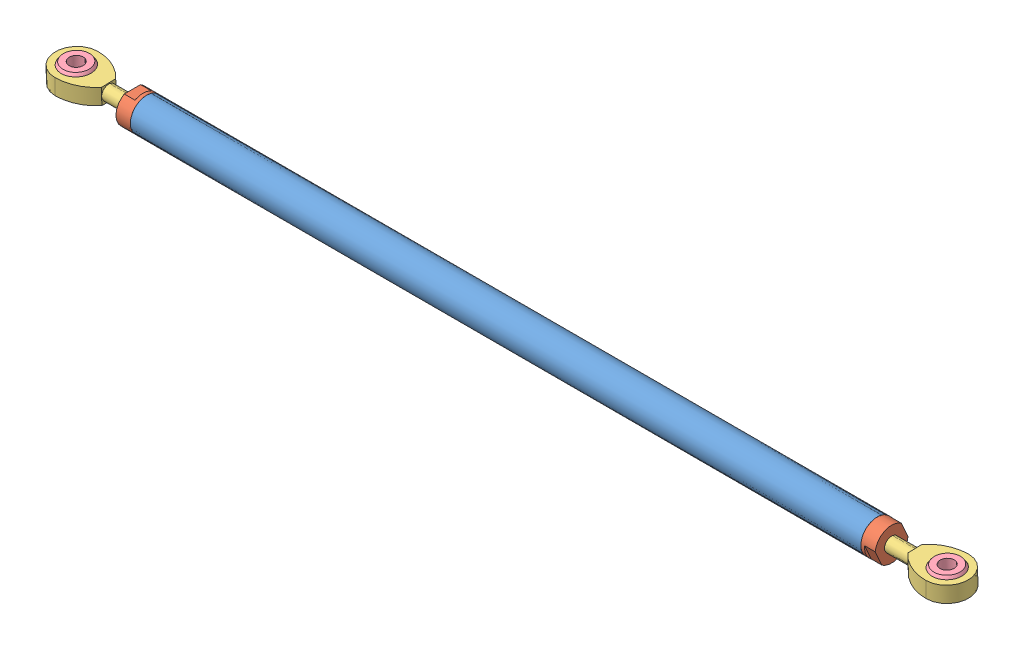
SolidWorks assembly Tie Rod Assembly.SLDASM, configuration Default (file format 4400). Lengths in mm.
Overall size (405.13 19.3 19.32).
9 component instances, 4 part files, 7 mates.
Components (placement in the parent):
- Tie Rod Tube - CF-1: Tie Rod Tube - CF.SLDPRT [Default] at origin size (323.85 14.58 14.58)
- Pull Rod Plug-1: Pull Rod Plug.SLDPRT [Default] at (-168.275 0 0) x (0 0 1) z (-1 0 0) size (14.61 14.61 35.88)
- Pull Rod Plug-2: Pull Rod Plug.SLDPRT [Default] at (168.275 0 0) x (0 -0.9126 -0.408853) z (1 0 0) size (14.61 14.61 35.88)
- Rod End Assembly-1: Rod End Assembly.SLDASM [Default] at (193.04 0 0) x (1 0 0) z (0 -0.028657 0.999589) size (49.23 9.53 19.05)
  - Rod End Outter-1: Rod End Outter.SLDPRT [Default] at origin size (49.23 7.14 19.05)
  - Spherical - Inner-1: Spherical - Inner.SLDPRT [Default] at origin size (15.06 9.53 15.06)
- Rod End Assembly-2: Rod End Assembly.SLDASM [Default] at (-193.04 0 0) x (-1 0 0) z (0 -0.028657 0.999589) size (49.23 9.53 19.05)
  - Rod End Outter-1: Rod End Outter.SLDPRT [Default] at origin size (49.23 7.14 19.05)
  - Spherical - Inner-1: Spherical - Inner.SLDPRT [Default] at origin size (15.06 9.53 15.06)
Mates (geometry in assembly coordinates):
- Concentric1: concentric anti-aligned: cylinder of Tie Rod Tube - CF-1 through (88.8575 0 0) axis (1 0 0) radius 6.35; cylinder of Pull Rod Plug-1 through (-136.525 0 0) axis (-1 0 0) radius 6.1468
- Coincident11: coincident anti-aligned: plane of Tie Rod Tube - CF-1 through (-161.925 7.2898 0) normal (-1 0 0); plane of Pull Rod Plug-1 through (-161.925 0 0) normal (1 0 0)
- Concentric2: concentric aligned: cylinder of Tie Rod Tube - CF-1 through (88.8575 0 0) axis (1 0 0) radius 6.35; cylinder of Pull Rod Plug-2 through (136.525 0 0) axis (1 0 0) radius 6.1468
- Coincident10: coincident anti-aligned: plane of Tie Rod Tube - CF-1 through (161.925 6.35 0) normal (1 0 0); plane of Pull Rod Plug-2 through (161.925 0 0) normal (-1 0 0)
- Concentric3: concentric aligned: cylinder of Tie Rod Tube - CF-1 through (88.8575 0 0) axis (1 0 0) radius 7.2898; cylinder of ? through (153.3398 0 0) axis (1 0 0) radius 3.175
- Concentric4: concentric anti-aligned: cylinder of Tie Rod Tube - CF-1 through (88.8575 0 0) axis (1 0 0) radius 7.2898; cylinder of ? through (-153.3398 0 0) axis (-1 0 0) radius 3.175
- Coincident8: coincident anti-aligned: plane of ? through (193.04 0 0) normal (0 0.999589 0.028657); plane of ?
